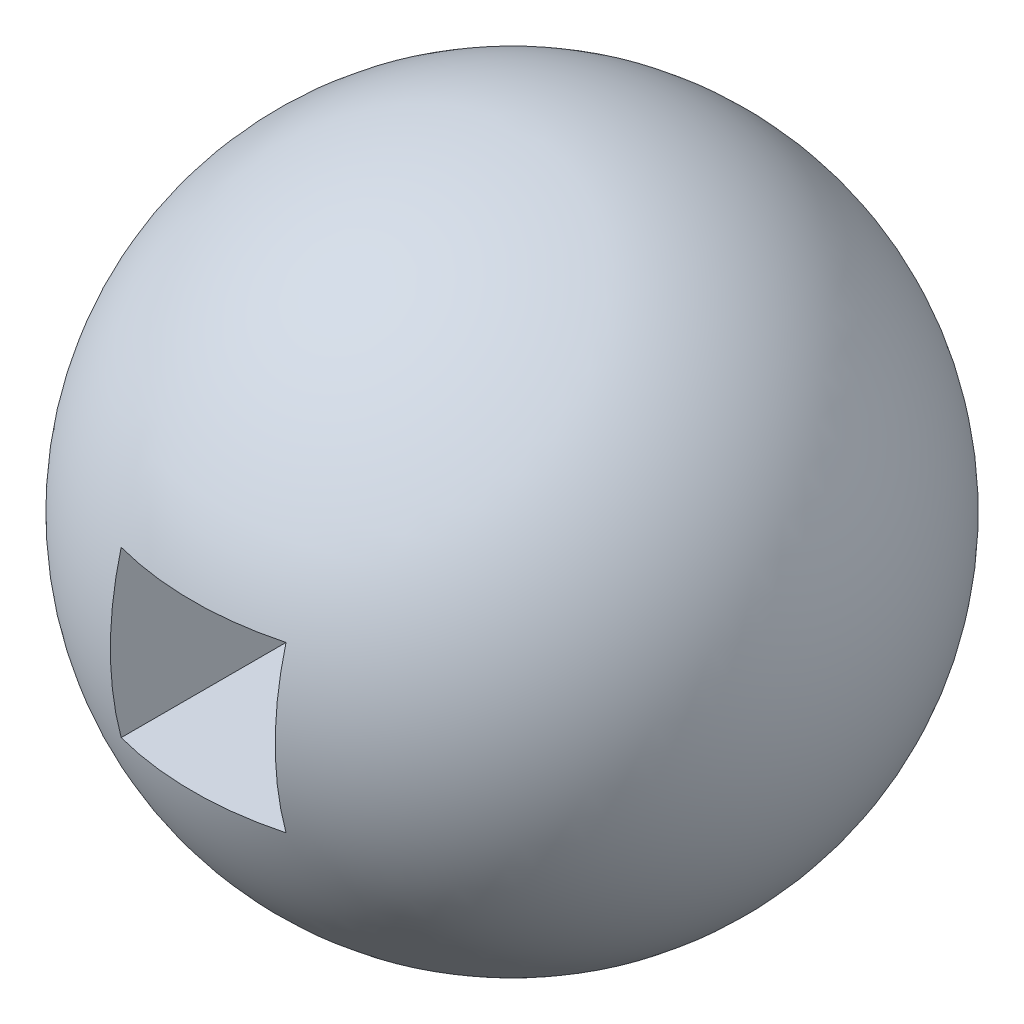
ISO-10303-21;
HEADER;
FILE_DESCRIPTION(('STEP AP214'),'2;1');
FILE_NAME('part.step','',(''),(''),'','','');
FILE_SCHEMA(('AUTOMOTIVE_DESIGN { 1 0 10303 214 1 1 1 1 }'));
ENDSEC;
DATA;
#1=APPLICATION_CONTEXT('core data for automotive mechanical design processes');
#2=APPLICATION_PROTOCOL_DEFINITION('international standard','automotive_design',2000,#1);
#3=PRODUCT_CONTEXT('',#1,'mechanical');
#4=PRODUCT('Part','Part','',(#3));
#5=PRODUCT_RELATED_PRODUCT_CATEGORY('part','',(#4));
#6=PRODUCT_DEFINITION_FORMATION('','',#4);
#7=PRODUCT_DEFINITION_CONTEXT('part definition',#1,'design');
#8=PRODUCT_DEFINITION('design','',#6,#7);
#9=PRODUCT_DEFINITION_SHAPE('','',#8);
#10=(LENGTH_UNIT() NAMED_UNIT(*) SI_UNIT(.MILLI.,.METRE.));
#11=(NAMED_UNIT(*) PLANE_ANGLE_UNIT() SI_UNIT($,.RADIAN.));
#12=(NAMED_UNIT(*) SI_UNIT($,.STERADIAN.) SOLID_ANGLE_UNIT());
#13=UNCERTAINTY_MEASURE_WITH_UNIT(LENGTH_MEASURE(1.E-05),#10,'distance_accuracy_value','');
#14=(GEOMETRIC_REPRESENTATION_CONTEXT(3) GLOBAL_UNCERTAINTY_ASSIGNED_CONTEXT((#13)) GLOBAL_UNIT_ASSIGNED_CONTEXT((#10,
#11,#12)) REPRESENTATION_CONTEXT('',''));
#15=CARTESIAN_POINT('',(0.,0.,0.));
#16=DIRECTION('',(0.,0.,1.));
#17=DIRECTION('',(1.,0.,0.));
#18=AXIS2_PLACEMENT_3D('',#15,#16,#17);
#19=CARTESIAN_POINT('',(-0.5,0.5,-2.001));
#20=DIRECTION('',(0.,1.,0.));
#21=DIRECTION('',(0.,0.,1.));
#22=AXIS2_PLACEMENT_3D('',#19,#20,#21);
#23=PLANE('',#22);
#24=DIRECTION('',(0.,0.,1.));
#25=VECTOR('',#24,1.);
#26=CARTESIAN_POINT('',(0.5,0.5,-2.001));
#27=LINE('',#26,#25);
#28=CARTESIAN_POINT('',(0.5,0.5,-1.87082869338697));
#29=VERTEX_POINT('',#28);
#30=CARTESIAN_POINT('',(0.5,0.5,1.87082869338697));
#31=VERTEX_POINT('',#30);
#32=EDGE_CURVE('E11',#29,#31,#27,.T.);
#33=ORIENTED_EDGE('',*,*,#32,.T.);
#34=CARTESIAN_POINT('',(0.,0.5,0.));
#35=DIRECTION('',(0.,-1.,0.));
#36=DIRECTION('',(0.,0.,-1.));
#37=AXIS2_PLACEMENT_3D('',#34,#35,#36);
#38=CIRCLE('',#37,1.93649167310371);
#39=CARTESIAN_POINT('',(-0.5,0.5,1.87082869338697));
#40=VERTEX_POINT('',#39);
#41=EDGE_CURVE('E89',#31,#40,#38,.T.);
#42=ORIENTED_EDGE('',*,*,#41,.T.);
#43=DIRECTION('',(0.,0.,1.));
#44=VECTOR('',#43,1.);
#45=CARTESIAN_POINT('',(-0.5,0.5,-2.001));
#46=LINE('',#45,#44);
#47=CARTESIAN_POINT('',(-0.5,0.5,-1.87082869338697));
#48=VERTEX_POINT('',#47);
#49=EDGE_CURVE('E84',#48,#40,#46,.T.);
#50=ORIENTED_EDGE('',*,*,#49,.F.);
#51=CARTESIAN_POINT('',(0.,0.5,0.));
#52=DIRECTION('',(0.,1.,0.));
#53=DIRECTION('',(0.,0.,1.));
#54=AXIS2_PLACEMENT_3D('',#51,#52,#53);
#55=CIRCLE('',#54,1.93649167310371);
#56=EDGE_CURVE('E88',#29,#48,#55,.T.);
#57=ORIENTED_EDGE('',*,*,#56,.F.);
#58=EDGE_LOOP('',(#33,#42,#50,#57));
#59=FACE_BOUND('',#58,.T.);
#60=ADVANCED_FACE('F33',(#59),#23,.F.);
#61=CARTESIAN_POINT('',(-0.5,-0.5,-2.001));
#62=DIRECTION('',(-1.,0.,0.));
#63=DIRECTION('',(0.,0.,1.));
#64=AXIS2_PLACEMENT_3D('',#61,#62,#63);
#65=PLANE('',#64);
#66=ORIENTED_EDGE('',*,*,#49,.T.);
#67=CARTESIAN_POINT('',(-0.5,0.,0.));
#68=DIRECTION('',(1.,0.,0.));
#69=DIRECTION('',(0.,0.,-1.));
#70=AXIS2_PLACEMENT_3D('',#67,#68,#69);
#71=CIRCLE('',#70,1.93649167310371);
#72=CARTESIAN_POINT('',(-0.5,-0.5,1.87082869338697));
#73=VERTEX_POINT('',#72);
#74=EDGE_CURVE('E81',#40,#73,#71,.T.);
#75=ORIENTED_EDGE('',*,*,#74,.T.);
#76=DIRECTION('',(0.,0.,1.));
#77=VECTOR('',#76,1.);
#78=CARTESIAN_POINT('',(-0.5,-0.5,-2.001));
#79=LINE('',#78,#77);
#80=CARTESIAN_POINT('',(-0.5,-0.5,-1.87082869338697));
#81=VERTEX_POINT('',#80);
#82=EDGE_CURVE('E71',#81,#73,#79,.T.);
#83=ORIENTED_EDGE('',*,*,#82,.F.);
#84=CARTESIAN_POINT('',(-0.5,0.,0.));
#85=DIRECTION('',(-1.,0.,0.));
#86=DIRECTION('',(0.,0.,1.));
#87=AXIS2_PLACEMENT_3D('',#84,#85,#86);
#88=CIRCLE('',#87,1.93649167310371);
#89=EDGE_CURVE('E78',#48,#81,#88,.T.);
#90=ORIENTED_EDGE('',*,*,#89,.F.);
#91=EDGE_LOOP('',(#66,#75,#83,#90));
#92=FACE_BOUND('',#91,.T.);
#93=ADVANCED_FACE('F82',(#92),#65,.F.);
#94=CARTESIAN_POINT('',(-0.5,-0.5,-2.001));
#95=DIRECTION('',(0.,-1.,0.));
#96=DIRECTION('',(0.,0.,-1.));
#97=AXIS2_PLACEMENT_3D('',#94,#95,#96);
#98=PLANE('',#97);
#99=ORIENTED_EDGE('',*,*,#82,.T.);
#100=CARTESIAN_POINT('',(0.,-0.5,0.));
#101=DIRECTION('',(0.,1.,0.));
#102=DIRECTION('',(0.,0.,1.));
#103=AXIS2_PLACEMENT_3D('',#100,#101,#102);
#104=CIRCLE('',#103,1.93649167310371);
#105=CARTESIAN_POINT('',(0.5,-0.5,1.87082869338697));
#106=VERTEX_POINT('',#105);
#107=EDGE_CURVE('E48',#73,#106,#104,.T.);
#108=ORIENTED_EDGE('',*,*,#107,.T.);
#109=DIRECTION('',(0.,0.,1.));
#110=VECTOR('',#109,1.);
#111=CARTESIAN_POINT('',(0.5,-0.5,-2.001));
#112=LINE('',#111,#110);
#113=CARTESIAN_POINT('',(0.5,-0.5,-1.87082869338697));
#114=VERTEX_POINT('',#113);
#115=EDGE_CURVE('E102',#114,#106,#112,.T.);
#116=ORIENTED_EDGE('',*,*,#115,.F.);
#117=CARTESIAN_POINT('',(0.,-0.5,0.));
#118=DIRECTION('',(0.,-1.,0.));
#119=DIRECTION('',(0.,0.,-1.));
#120=AXIS2_PLACEMENT_3D('',#117,#118,#119);
#121=CIRCLE('',#120,1.93649167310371);
#122=EDGE_CURVE('E75',#81,#114,#121,.T.);
#123=ORIENTED_EDGE('',*,*,#122,.F.);
#124=EDGE_LOOP('',(#99,#108,#116,#123));
#125=FACE_BOUND('',#124,.T.);
#126=ADVANCED_FACE('F73',(#125),#98,.F.);
#127=CARTESIAN_POINT('',(0.5,-0.5,-2.001));
#128=DIRECTION('',(1.,0.,0.));
#129=DIRECTION('',(0.,0.,-1.));
#130=AXIS2_PLACEMENT_3D('',#127,#128,#129);
#131=PLANE('',#130);
#132=ORIENTED_EDGE('',*,*,#115,.T.);
#133=CARTESIAN_POINT('',(0.5,0.,0.));
#134=DIRECTION('',(-1.,0.,0.));
#135=DIRECTION('',(0.,0.,1.));
#136=AXIS2_PLACEMENT_3D('',#133,#134,#135);
#137=CIRCLE('',#136,1.93649167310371);
#138=EDGE_CURVE('E93',#106,#31,#137,.T.);
#139=ORIENTED_EDGE('',*,*,#138,.T.);
#140=ORIENTED_EDGE('',*,*,#32,.F.);
#141=CARTESIAN_POINT('',(0.5,0.,0.));
#142=DIRECTION('',(1.,0.,0.));
#143=DIRECTION('',(0.,0.,-1.));
#144=AXIS2_PLACEMENT_3D('',#141,#142,#143);
#145=CIRCLE('',#144,1.93649167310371);
#146=EDGE_CURVE('E41',#114,#29,#145,.T.);
#147=ORIENTED_EDGE('',*,*,#146,.F.);
#148=EDGE_LOOP('',(#132,#139,#140,#147));
#149=FACE_BOUND('',#148,.T.);
#150=ADVANCED_FACE('F105',(#149),#131,.F.);
#151=CARTESIAN_POINT('',(0.,0.,0.));
#152=DIRECTION('',(0.,1.,0.));
#153=DIRECTION('',(1.,0.,0.));
#154=AXIS2_PLACEMENT_3D('',#151,#152,#153);
#155=SPHERICAL_SURFACE('',#154,2.);
#156=ORIENTED_EDGE('',*,*,#41,.F.);
#157=ORIENTED_EDGE('',*,*,#138,.F.);
#158=ORIENTED_EDGE('',*,*,#107,.F.);
#159=ORIENTED_EDGE('',*,*,#74,.F.);
#160=EDGE_LOOP('',(#156,#157,#158,#159));
#161=FACE_BOUND('',#160,.T.);
#162=ORIENTED_EDGE('',*,*,#56,.T.);
#163=ORIENTED_EDGE('',*,*,#89,.T.);
#164=ORIENTED_EDGE('',*,*,#122,.T.);
#165=ORIENTED_EDGE('',*,*,#146,.T.);
#166=EDGE_LOOP('',(#162,#163,#164,#165));
#167=FACE_BOUND('',#166,.T.);
#168=ADVANCED_FACE('F35',(#161,#167),#155,.T.);
#169=CLOSED_SHELL('',(#60,#93,#126,#150,#168));
#170=MANIFOLD_SOLID_BREP('B2',#169);
#171=ADVANCED_BREP_SHAPE_REPRESENTATION('',(#18,#170),#14);
#172=SHAPE_DEFINITION_REPRESENTATION(#9,#171);
ENDSEC;
END-ISO-10303-21;
